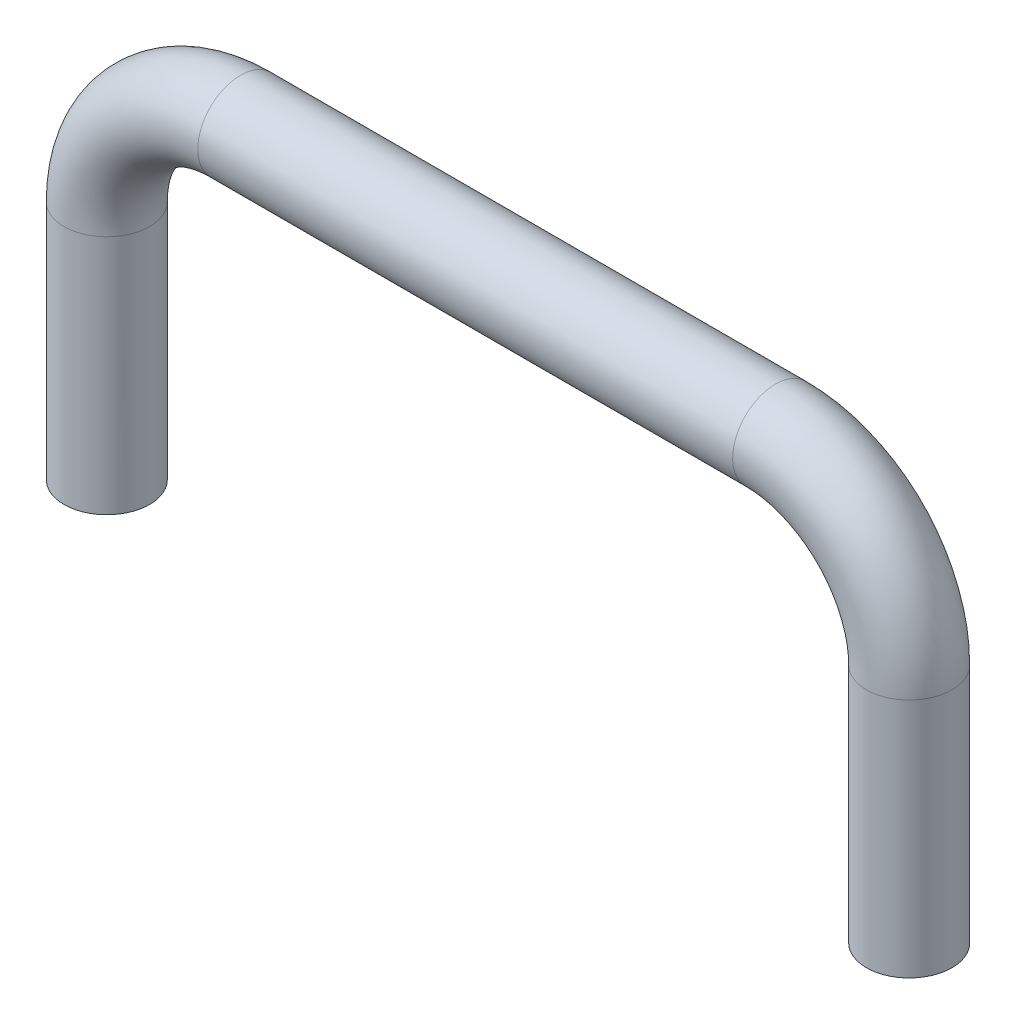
ISO-10303-21;
HEADER;
FILE_DESCRIPTION(('STEP AP214'),'2;1');
FILE_NAME('part.step','',(''),(''),'','','');
FILE_SCHEMA(('AUTOMOTIVE_DESIGN { 1 0 10303 214 1 1 1 1 }'));
ENDSEC;
DATA;
#1=APPLICATION_CONTEXT('core data for automotive mechanical design processes');
#2=APPLICATION_PROTOCOL_DEFINITION('international standard','automotive_design',2000,#1);
#3=PRODUCT_CONTEXT('',#1,'mechanical');
#4=PRODUCT('Part','Part','',(#3));
#5=PRODUCT_RELATED_PRODUCT_CATEGORY('part','',(#4));
#6=PRODUCT_DEFINITION_FORMATION('','',#4);
#7=PRODUCT_DEFINITION_CONTEXT('part definition',#1,'design');
#8=PRODUCT_DEFINITION('design','',#6,#7);
#9=PRODUCT_DEFINITION_SHAPE('','',#8);
#10=(LENGTH_UNIT() NAMED_UNIT(*) SI_UNIT(.MILLI.,.METRE.));
#11=(NAMED_UNIT(*) PLANE_ANGLE_UNIT() SI_UNIT($,.RADIAN.));
#12=(NAMED_UNIT(*) SI_UNIT($,.STERADIAN.) SOLID_ANGLE_UNIT());
#13=UNCERTAINTY_MEASURE_WITH_UNIT(LENGTH_MEASURE(1.E-05),#10,'distance_accuracy_value','');
#14=(GEOMETRIC_REPRESENTATION_CONTEXT(3) GLOBAL_UNCERTAINTY_ASSIGNED_CONTEXT((#13)) GLOBAL_UNIT_ASSIGNED_CONTEXT((#10,
#11,#12)) REPRESENTATION_CONTEXT('',''));
#15=CARTESIAN_POINT('',(0.,0.,0.));
#16=DIRECTION('',(0.,0.,1.));
#17=DIRECTION('',(1.,0.,0.));
#18=AXIS2_PLACEMENT_3D('',#15,#16,#17);
#19=CARTESIAN_POINT('',(75.,45.,0.));
#20=DIRECTION('',(0.,-1.,0.));
#21=DIRECTION('',(1.,0.,0.));
#22=AXIS2_PLACEMENT_3D('',#19,#20,#21);
#23=CYLINDRICAL_SURFACE('',#22,8.);
#24=CARTESIAN_POINT('',(75.,45.,0.));
#25=DIRECTION('',(0.,-1.,0.));
#26=DIRECTION('',(0.,0.,1.));
#27=AXIS2_PLACEMENT_3D('',#24,#25,#26);
#28=CIRCLE('',#27,8.);
#29=CARTESIAN_POINT('',(83.,45.,0.));
#30=VERTEX_POINT('',#29);
#31=EDGE_CURVE('E35',#30,#30,#28,.T.);
#32=CARTESIAN_POINT('',(75.,0.,0.));
#33=DIRECTION('',(0.,-1.,0.));
#34=DIRECTION('',(0.,0.,1.));
#35=AXIS2_PLACEMENT_3D('',#32,#33,#34);
#36=CIRCLE('',#35,8.);
#37=CARTESIAN_POINT('',(83.,0.,0.));
#38=VERTEX_POINT('',#37);
#39=EDGE_CURVE('E10',#38,#38,#36,.T.);
#40=CARTESIAN_POINT('',(83.,45.,0.));
#41=CARTESIAN_POINT('',(83.,44.53125,0.));
#42=CARTESIAN_POINT('',(83.,44.0625,0.));
#43=CARTESIAN_POINT('',(83.,43.125,0.));
#44=CARTESIAN_POINT('',(83.,42.65625,0.));
#45=CARTESIAN_POINT('',(83.,41.71875,0.));
#46=CARTESIAN_POINT('',(83.,41.25,0.));
#47=CARTESIAN_POINT('',(83.,40.3125,0.));
#48=CARTESIAN_POINT('',(83.,39.84375,0.));
#49=CARTESIAN_POINT('',(83.,38.90625,0.));
#50=CARTESIAN_POINT('',(83.,38.4375,0.));
#51=CARTESIAN_POINT('',(83.,37.5,0.));
#52=CARTESIAN_POINT('',(83.,37.03125,0.));
#53=CARTESIAN_POINT('',(83.,36.09375,0.));
#54=CARTESIAN_POINT('',(83.,35.625,0.));
#55=CARTESIAN_POINT('',(83.,34.6875,0.));
#56=CARTESIAN_POINT('',(83.,34.21875,0.));
#57=CARTESIAN_POINT('',(83.,33.28125,0.));
#58=CARTESIAN_POINT('',(83.,32.8125,0.));
#59=CARTESIAN_POINT('',(83.,31.875,0.));
#60=CARTESIAN_POINT('',(83.,31.40625,0.));
#61=CARTESIAN_POINT('',(83.,30.46875,0.));
#62=CARTESIAN_POINT('',(83.,30.,0.));
#63=CARTESIAN_POINT('',(83.,29.0625,0.));
#64=CARTESIAN_POINT('',(83.,28.59375,0.));
#65=CARTESIAN_POINT('',(83.,27.65625,0.));
#66=CARTESIAN_POINT('',(83.,27.1875,0.));
#67=CARTESIAN_POINT('',(83.,26.25,0.));
#68=CARTESIAN_POINT('',(83.,25.78125,0.));
#69=CARTESIAN_POINT('',(83.,24.84375,0.));
#70=CARTESIAN_POINT('',(83.,24.375,0.));
#71=CARTESIAN_POINT('',(83.,23.4375,0.));
#72=CARTESIAN_POINT('',(83.,22.96875,0.));
#73=CARTESIAN_POINT('',(83.,22.03125,0.));
#74=CARTESIAN_POINT('',(83.,21.5625,0.));
#75=CARTESIAN_POINT('',(83.,20.625,0.));
#76=CARTESIAN_POINT('',(83.,20.15625,0.));
#77=CARTESIAN_POINT('',(83.,19.21875,0.));
#78=CARTESIAN_POINT('',(83.,18.75,0.));
#79=CARTESIAN_POINT('',(83.,17.8125,0.));
#80=CARTESIAN_POINT('',(83.,17.34375,0.));
#81=CARTESIAN_POINT('',(83.,16.40625,0.));
#82=CARTESIAN_POINT('',(83.,15.9375,0.));
#83=CARTESIAN_POINT('',(83.,15.,0.));
#84=CARTESIAN_POINT('',(83.,14.53125,0.));
#85=CARTESIAN_POINT('',(83.,13.59375,0.));
#86=CARTESIAN_POINT('',(83.,13.125,0.));
#87=CARTESIAN_POINT('',(83.,12.1875,0.));
#88=CARTESIAN_POINT('',(83.,11.71875,0.));
#89=CARTESIAN_POINT('',(83.,10.78125,0.));
#90=CARTESIAN_POINT('',(83.,10.3125,0.));
#91=CARTESIAN_POINT('',(83.,9.375,0.));
#92=CARTESIAN_POINT('',(83.,8.90625,0.));
#93=CARTESIAN_POINT('',(83.,7.96875,0.));
#94=CARTESIAN_POINT('',(83.,7.5,0.));
#95=CARTESIAN_POINT('',(83.,6.5625,0.));
#96=CARTESIAN_POINT('',(83.,6.09375,0.));
#97=CARTESIAN_POINT('',(83.,5.15625,0.));
#98=CARTESIAN_POINT('',(83.,4.6875,0.));
#99=CARTESIAN_POINT('',(83.,3.75,0.));
#100=CARTESIAN_POINT('',(83.,3.28125,0.));
#101=CARTESIAN_POINT('',(83.,2.34375,0.));
#102=CARTESIAN_POINT('',(83.,1.875,0.));
#103=CARTESIAN_POINT('',(83.,0.937499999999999,0.));
#104=CARTESIAN_POINT('',(83.,0.46875,0.));
#105=CARTESIAN_POINT('',(83.,0.,0.));
#106=B_SPLINE_CURVE_WITH_KNOTS('',3,(#40,#41,#42,#43,#44,#45,#46,#47,#48,#49,#50,#51,#52,#53,
#54,#55,#56,#57,#58,#59,#60,#61,#62,#63,#64,#65,#66,#67,#68,#69,#70,#71,#72,#73,#74,#75,#76,#77,
#78,#79,#80,#81,#82,#83,#84,#85,#86,#87,#88,#89,#90,#91,#92,#93,#94,#95,#96,#97,#98,#99,#100,
#101,#102,#103,#104,#105),.UNSPECIFIED.,.F.,.F.,(4,2,2,2,2,2,2,2,2,2,2,2,2,2,2,2,2,2,2,2,2,2,2,
2,2,2,2,2,2,2,2,2,4),(0.,1.40625,2.8125,4.21875,5.625,7.03125,8.43749999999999,9.84375,11.25,
12.65625,14.0625,15.46875,16.875,18.28125,19.6875,21.09375,22.5,23.90625,25.3125,26.71875,
28.125,29.53125,30.9375,32.34375,33.75,35.15625,36.5625,37.96875,39.375,40.78125,42.1875,
43.59375,45.),.UNSPECIFIED.);
#107=EDGE_CURVE('BSEAM29',#30,#38,#106,.T.);
#108=ORIENTED_EDGE('',*,*,#31,.T.);
#109=ORIENTED_EDGE('',*,*,#39,.F.);
#110=ORIENTED_EDGE('',*,*,#107,.T.);
#111=ORIENTED_EDGE('',*,*,#107,.F.);
#112=EDGE_LOOP('',(#108,#110,#109,#111));
#113=FACE_BOUND('',#112,.T.);
#114=ADVANCED_FACE('F29',(#113),#23,.T.);
#115=CARTESIAN_POINT('',(50.,45.,0.));
#116=DIRECTION('',(0.,0.,-1.));
#117=DIRECTION('',(-1.,0.,0.));
#118=AXIS2_PLACEMENT_3D('',#115,#116,#117);
#119=TOROIDAL_SURFACE('',#118,25.,8.);
#120=CARTESIAN_POINT('',(50.,70.,0.));
#121=DIRECTION('',(1.,0.,0.));
#122=DIRECTION('',(0.,0.,1.));
#123=AXIS2_PLACEMENT_3D('',#120,#121,#122);
#124=CIRCLE('',#123,8.);
#125=CARTESIAN_POINT('',(50.,78.,0.));
#126=VERTEX_POINT('',#125);
#127=EDGE_CURVE('E39',#126,#126,#124,.T.);
#128=CARTESIAN_POINT('',(50.,45.,0.));
#129=DIRECTION('',(0.,0.,-1.));
#130=DIRECTION('',(-1.,0.,0.));
#131=AXIS2_PLACEMENT_3D('',#128,#129,#130);
#132=CIRCLE('',#131,33.);
#133=EDGE_CURVE('',#126,#30,#132,.T.);
#134=ORIENTED_EDGE('',*,*,#127,.T.);
#135=ORIENTED_EDGE('',*,*,#31,.F.);
#136=ORIENTED_EDGE('',*,*,#133,.T.);
#137=ORIENTED_EDGE('',*,*,#133,.F.);
#138=EDGE_LOOP('',(#134,#136,#135,#137));
#139=FACE_BOUND('',#138,.T.);
#140=ADVANCED_FACE('F73',(#139),#119,.T.);
#141=CARTESIAN_POINT('',(-50.,70.,0.));
#142=DIRECTION('',(1.,0.,0.));
#143=DIRECTION('',(0.,0.,-1.));
#144=AXIS2_PLACEMENT_3D('',#141,#142,#143);
#145=CYLINDRICAL_SURFACE('',#144,8.);
#146=CARTESIAN_POINT('',(-50.,70.,0.));
#147=DIRECTION('',(1.,0.,0.));
#148=DIRECTION('',(0.,0.,1.));
#149=AXIS2_PLACEMENT_3D('',#146,#147,#148);
#150=CIRCLE('',#149,8.);
#151=CARTESIAN_POINT('',(-50.,78.,0.));
#152=VERTEX_POINT('',#151);
#153=EDGE_CURVE('E43',#152,#152,#150,.T.);
#154=ORIENTED_EDGE('',*,*,#153,.T.);
#155=EDGE_LOOP('',(#154));
#156=FACE_BOUND('',#155,.T.);
#157=ORIENTED_EDGE('',*,*,#127,.F.);
#158=EDGE_LOOP('',(#157));
#159=FACE_BOUND('',#158,.T.);
#160=ADVANCED_FACE('F77',(#156,#159),#145,.T.);
#161=CARTESIAN_POINT('',(-50.,45.,0.));
#162=DIRECTION('',(0.,0.,-1.));
#163=DIRECTION('',(-1.,0.,0.));
#164=AXIS2_PLACEMENT_3D('',#161,#162,#163);
#165=TOROIDAL_SURFACE('',#164,25.,8.);
#166=CARTESIAN_POINT('',(-75.,45.,0.));
#167=DIRECTION('',(0.,1.,0.));
#168=DIRECTION('',(0.,0.,1.));
#169=AXIS2_PLACEMENT_3D('',#166,#167,#168);
#170=CIRCLE('',#169,8.);
#171=CARTESIAN_POINT('',(-83.,45.,0.));
#172=VERTEX_POINT('',#171);
#173=EDGE_CURVE('E48',#172,#172,#170,.T.);
#174=CARTESIAN_POINT('',(-50.,45.,0.));
#175=DIRECTION('',(0.,0.,-1.));
#176=DIRECTION('',(-1.,0.,0.));
#177=AXIS2_PLACEMENT_3D('',#174,#175,#176);
#178=CIRCLE('',#177,33.);
#179=EDGE_CURVE('',#172,#152,#178,.T.);
#180=ORIENTED_EDGE('',*,*,#173,.T.);
#181=ORIENTED_EDGE('',*,*,#153,.F.);
#182=ORIENTED_EDGE('',*,*,#179,.T.);
#183=ORIENTED_EDGE('',*,*,#179,.F.);
#184=EDGE_LOOP('',(#180,#182,#181,#183));
#185=FACE_BOUND('',#184,.T.);
#186=ADVANCED_FACE('F55',(#185),#165,.T.);
#187=CARTESIAN_POINT('',(-75.,45.,0.));
#188=DIRECTION('',(0.,-1.,0.));
#189=DIRECTION('',(0.,0.,-1.));
#190=AXIS2_PLACEMENT_3D('',#187,#188,#189);
#191=CYLINDRICAL_SURFACE('',#190,8.);
#192=ORIENTED_EDGE('',*,*,#173,.F.);
#193=EDGE_LOOP('',(#192));
#194=FACE_BOUND('',#193,.T.);
#195=CARTESIAN_POINT('',(-75.,0.,0.));
#196=DIRECTION('',(0.,1.,0.));
#197=DIRECTION('',(0.,0.,1.));
#198=AXIS2_PLACEMENT_3D('',#195,#196,#197);
#199=CIRCLE('',#198,8.);
#200=CARTESIAN_POINT('',(-75.,0.,8.));
#201=VERTEX_POINT('',#200);
#202=EDGE_CURVE('E49',#201,#201,#199,.T.);
#203=ORIENTED_EDGE('',*,*,#202,.T.);
#204=EDGE_LOOP('',(#203));
#205=FACE_BOUND('',#204,.T.);
#206=ADVANCED_FACE('F58',(#194,#205),#191,.T.);
#207=CARTESIAN_POINT('',(75.,0.,0.));
#208=DIRECTION('',(0.,-1.,0.));
#209=DIRECTION('',(0.,0.,1.));
#210=AXIS2_PLACEMENT_3D('',#207,#208,#209);
#211=PLANE('',#210);
#212=ORIENTED_EDGE('',*,*,#39,.T.);
#213=EDGE_LOOP('',(#212));
#214=FACE_BOUND('',#213,.T.);
#215=ADVANCED_FACE('F61',(#214),#211,.T.);
#216=CARTESIAN_POINT('',(-75.,0.,0.));
#217=DIRECTION('',(0.,1.,0.));
#218=DIRECTION('',(0.,0.,1.));
#219=AXIS2_PLACEMENT_3D('',#216,#217,#218);
#220=PLANE('',#219);
#221=ORIENTED_EDGE('',*,*,#202,.F.);
#222=EDGE_LOOP('',(#221));
#223=FACE_BOUND('',#222,.T.);
#224=ADVANCED_FACE('F65',(#223),#220,.F.);
#225=CLOSED_SHELL('',(#114,#140,#160,#186,#206,#215,#224));
#226=MANIFOLD_SOLID_BREP('B2',#225);
#227=ADVANCED_BREP_SHAPE_REPRESENTATION('',(#18,#226),#14);
#228=SHAPE_DEFINITION_REPRESENTATION(#9,#227);
ENDSEC;
END-ISO-10303-21;
